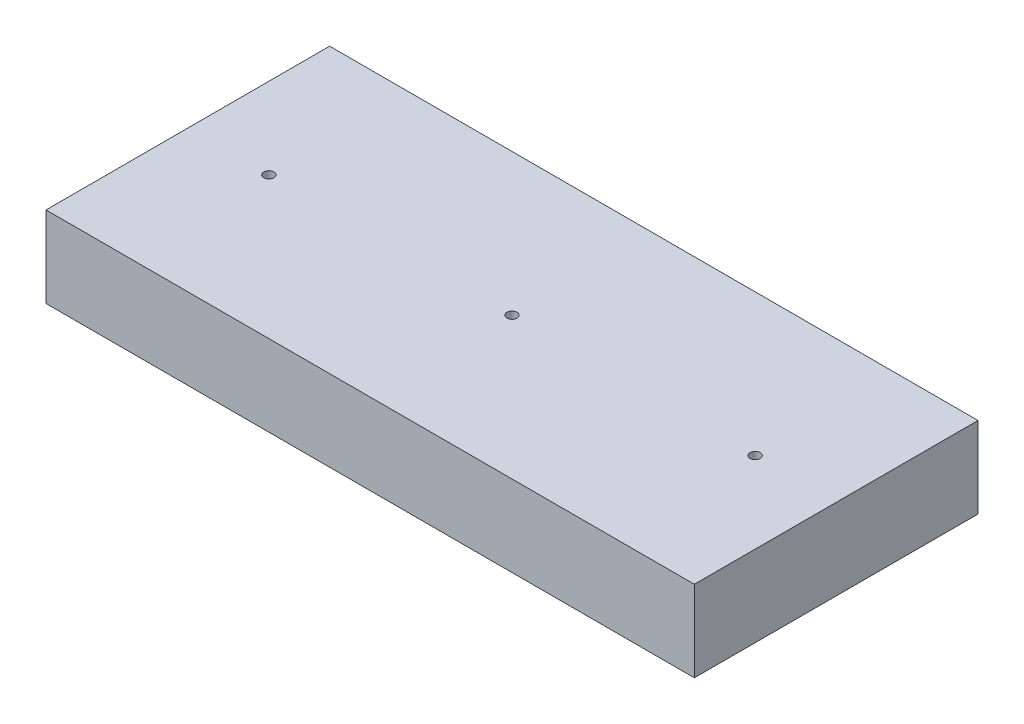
ISO-10303-21;
HEADER;
FILE_DESCRIPTION(('STEP AP214'),'2;1');
FILE_NAME('part.step','',(''),(''),'','','');
FILE_SCHEMA(('AUTOMOTIVE_DESIGN { 1 0 10303 214 1 1 1 1 }'));
ENDSEC;
DATA;
#1=APPLICATION_CONTEXT('core data for automotive mechanical design processes');
#2=APPLICATION_PROTOCOL_DEFINITION('international standard','automotive_design',2000,#1);
#3=PRODUCT_CONTEXT('',#1,'mechanical');
#4=PRODUCT('Part','Part','',(#3));
#5=PRODUCT_RELATED_PRODUCT_CATEGORY('part','',(#4));
#6=PRODUCT_DEFINITION_FORMATION('','',#4);
#7=PRODUCT_DEFINITION_CONTEXT('part definition',#1,'design');
#8=PRODUCT_DEFINITION('design','',#6,#7);
#9=PRODUCT_DEFINITION_SHAPE('','',#8);
#10=(LENGTH_UNIT() NAMED_UNIT(*) SI_UNIT(.MILLI.,.METRE.));
#11=(NAMED_UNIT(*) PLANE_ANGLE_UNIT() SI_UNIT($,.RADIAN.));
#12=(NAMED_UNIT(*) SI_UNIT($,.STERADIAN.) SOLID_ANGLE_UNIT());
#13=UNCERTAINTY_MEASURE_WITH_UNIT(LENGTH_MEASURE(1.E-05),#10,'distance_accuracy_value','');
#14=(GEOMETRIC_REPRESENTATION_CONTEXT(3) GLOBAL_UNCERTAINTY_ASSIGNED_CONTEXT((#13)) GLOBAL_UNIT_ASSIGNED_CONTEXT((#10,
#11,#12)) REPRESENTATION_CONTEXT('',''));
#15=CARTESIAN_POINT('',(0.,0.,0.));
#16=DIRECTION('',(0.,0.,1.));
#17=DIRECTION('',(1.,0.,0.));
#18=AXIS2_PLACEMENT_3D('',#15,#16,#17);
#19=CARTESIAN_POINT('',(-101.6,25.4000000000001,-44.4499999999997));
#20=DIRECTION('',(1.,0.,0.));
#21=DIRECTION('',(0.,0.,-0.999999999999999));
#22=AXIS2_PLACEMENT_3D('',#19,#20,#21);
#23=PLANE('',#22);
#24=DIRECTION('',(0.,0.,0.999999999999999));
#25=VECTOR('',#24,1.);
#26=CARTESIAN_POINT('',(-101.6,0.,-44.45));
#27=LINE('',#26,#25);
#28=CARTESIAN_POINT('',(-101.6,0.,-44.45));
#29=VERTEX_POINT('',#28);
#30=CARTESIAN_POINT('',(-101.6,0.,44.4500000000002));
#31=VERTEX_POINT('',#30);
#32=EDGE_CURVE('E98',#29,#31,#27,.T.);
#33=ORIENTED_EDGE('',*,*,#32,.T.);
#34=DIRECTION('',(0.,-1.,0.));
#35=VECTOR('',#34,1.);
#36=CARTESIAN_POINT('',(-101.6,25.3999999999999,44.45));
#37=LINE('',#36,#35);
#38=CARTESIAN_POINT('',(-101.6,25.3999999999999,44.45));
#39=VERTEX_POINT('',#38);
#40=EDGE_CURVE('E11',#39,#31,#37,.T.);
#41=ORIENTED_EDGE('',*,*,#40,.F.);
#42=DIRECTION('',(0.,0.,0.999999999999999));
#43=VECTOR('',#42,1.);
#44=CARTESIAN_POINT('',(-101.6,25.4000000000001,-44.4499999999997));
#45=LINE('',#44,#43);
#46=CARTESIAN_POINT('',(-101.6,25.4000000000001,-44.4499999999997));
#47=VERTEX_POINT('',#46);
#48=EDGE_CURVE('E86',#47,#39,#45,.T.);
#49=ORIENTED_EDGE('',*,*,#48,.F.);
#50=DIRECTION('',(0.,-1.,0.));
#51=VECTOR('',#50,1.);
#52=CARTESIAN_POINT('',(-101.6,25.4000000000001,-44.4499999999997));
#53=LINE('',#52,#51);
#54=EDGE_CURVE('E94',#47,#29,#53,.T.);
#55=ORIENTED_EDGE('',*,*,#54,.T.);
#56=EDGE_LOOP('',(#33,#41,#49,#55));
#57=FACE_BOUND('',#56,.T.);
#58=ADVANCED_FACE('F35',(#57),#23,.F.);
#59=CARTESIAN_POINT('',(-101.6,25.3999999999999,44.45));
#60=DIRECTION('',(0.,0.,-0.999999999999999));
#61=DIRECTION('',(-1.,0.,0.));
#62=AXIS2_PLACEMENT_3D('',#59,#60,#61);
#63=PLANE('',#62);
#64=DIRECTION('',(1.,0.,0.));
#65=VECTOR('',#64,1.);
#66=CARTESIAN_POINT('',(-101.6,0.,44.4500000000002));
#67=LINE('',#66,#65);
#68=CARTESIAN_POINT('',(101.6,0.,44.45));
#69=VERTEX_POINT('',#68);
#70=EDGE_CURVE('E90',#31,#69,#67,.T.);
#71=ORIENTED_EDGE('',*,*,#70,.T.);
#72=DIRECTION('',(0.,-1.,0.));
#73=VECTOR('',#72,1.);
#74=CARTESIAN_POINT('',(101.6,25.3999999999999,44.4500000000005));
#75=LINE('',#74,#73);
#76=CARTESIAN_POINT('',(101.6,25.3999999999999,44.4500000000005));
#77=VERTEX_POINT('',#76);
#78=EDGE_CURVE('E43',#77,#69,#75,.T.);
#79=ORIENTED_EDGE('',*,*,#78,.F.);
#80=DIRECTION('',(1.,0.,0.));
#81=VECTOR('',#80,1.);
#82=CARTESIAN_POINT('',(-101.6,25.3999999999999,44.45));
#83=LINE('',#82,#81);
#84=EDGE_CURVE('E81',#39,#77,#83,.T.);
#85=ORIENTED_EDGE('',*,*,#84,.F.);
#86=ORIENTED_EDGE('',*,*,#40,.T.);
#87=EDGE_LOOP('',(#71,#79,#85,#86));
#88=FACE_BOUND('',#87,.T.);
#89=ADVANCED_FACE('F89',(#88),#63,.F.);
#90=CARTESIAN_POINT('',(101.6,25.4000000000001,-44.45));
#91=DIRECTION('',(-1.,0.,0.));
#92=DIRECTION('',(0.,0.,0.999999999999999));
#93=AXIS2_PLACEMENT_3D('',#90,#91,#92);
#94=PLANE('',#93);
#95=DIRECTION('',(0.,0.,-0.999999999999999));
#96=VECTOR('',#95,1.);
#97=CARTESIAN_POINT('',(101.6,0.,-44.45));
#98=LINE('',#97,#96);
#99=CARTESIAN_POINT('',(101.6,0.,-44.45));
#100=VERTEX_POINT('',#99);
#101=EDGE_CURVE('E68',#69,#100,#98,.T.);
#102=ORIENTED_EDGE('',*,*,#101,.T.);
#103=DIRECTION('',(0.,-1.,0.));
#104=VECTOR('',#103,1.);
#105=CARTESIAN_POINT('',(101.6,25.4000000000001,-44.45));
#106=LINE('',#105,#104);
#107=CARTESIAN_POINT('',(101.6,25.4000000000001,-44.45));
#108=VERTEX_POINT('',#107);
#109=EDGE_CURVE('E91',#108,#100,#106,.T.);
#110=ORIENTED_EDGE('',*,*,#109,.F.);
#111=DIRECTION('',(0.,0.,-0.999999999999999));
#112=VECTOR('',#111,1.);
#113=CARTESIAN_POINT('',(101.6,25.4000000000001,-44.45));
#114=LINE('',#113,#112);
#115=EDGE_CURVE('E84',#77,#108,#114,.T.);
#116=ORIENTED_EDGE('',*,*,#115,.F.);
#117=ORIENTED_EDGE('',*,*,#78,.T.);
#118=EDGE_LOOP('',(#102,#110,#116,#117));
#119=FACE_BOUND('',#118,.T.);
#120=ADVANCED_FACE('F92',(#119),#94,.F.);
#121=CARTESIAN_POINT('',(-101.6,25.4000000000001,-44.4499999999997));
#122=DIRECTION('',(0.,0.,0.999999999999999));
#123=DIRECTION('',(1.,0.,0.));
#124=AXIS2_PLACEMENT_3D('',#121,#122,#123);
#125=PLANE('',#124);
#126=DIRECTION('',(-1.,0.,0.));
#127=VECTOR('',#126,1.);
#128=CARTESIAN_POINT('',(-101.6,0.,-44.45));
#129=LINE('',#128,#127);
#130=EDGE_CURVE('E74',#100,#29,#129,.T.);
#131=ORIENTED_EDGE('',*,*,#130,.T.);
#132=ORIENTED_EDGE('',*,*,#54,.F.);
#133=DIRECTION('',(-1.,0.,0.));
#134=VECTOR('',#133,1.);
#135=CARTESIAN_POINT('',(-101.6,25.4000000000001,-44.4499999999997));
#136=LINE('',#135,#134);
#137=EDGE_CURVE('E51',#108,#47,#136,.T.);
#138=ORIENTED_EDGE('',*,*,#137,.F.);
#139=ORIENTED_EDGE('',*,*,#109,.T.);
#140=EDGE_LOOP('',(#131,#132,#138,#139));
#141=FACE_BOUND('',#140,.T.);
#142=ADVANCED_FACE('F106',(#141),#125,.F.);
#143=CARTESIAN_POINT('',(0.,25.4000000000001,0.));
#144=DIRECTION('',(0.,1.,0.));
#145=DIRECTION('',(0.,0.,0.999999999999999));
#146=AXIS2_PLACEMENT_3D('',#143,#144,#145);
#147=PLANE('',#146);
#148=CARTESIAN_POINT('',(0.,25.4000000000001,0.));
#149=DIRECTION('',(0.,-1.,0.));
#150=DIRECTION('',(0.,0.,-0.999999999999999));
#151=AXIS2_PLACEMENT_3D('',#148,#149,#150);
#152=CIRCLE('',#151,1.5875);
#153=CARTESIAN_POINT('',(0.,25.4000000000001,-1.5875));
#154=VERTEX_POINT('',#153);
#155=EDGE_CURVE('E121',#154,#154,#152,.T.);
#156=ORIENTED_EDGE('',*,*,#155,.T.);
#157=EDGE_LOOP('',(#156));
#158=FACE_BOUND('',#157,.T.);
#159=CARTESIAN_POINT('',(-76.1999999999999,25.4000000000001,2.22044604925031E-13));
#160=DIRECTION('',(0.,-1.,0.));
#161=DIRECTION('',(0.,0.,-0.999999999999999));
#162=AXIS2_PLACEMENT_3D('',#159,#160,#161);
#163=CIRCLE('',#162,1.58749999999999);
#164=CARTESIAN_POINT('',(-76.1999999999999,25.4000000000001,-1.58749999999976));
#165=VERTEX_POINT('',#164);
#166=EDGE_CURVE('E115',#165,#165,#163,.T.);
#167=ORIENTED_EDGE('',*,*,#166,.T.);
#168=EDGE_LOOP('',(#167));
#169=FACE_BOUND('',#168,.T.);
#170=CARTESIAN_POINT('',(76.2,25.4000000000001,2.22044604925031E-13));
#171=DIRECTION('',(0.,-1.,0.));
#172=DIRECTION('',(0.,0.,-0.999999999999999));
#173=AXIS2_PLACEMENT_3D('',#170,#171,#172);
#174=CIRCLE('',#173,1.58749999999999);
#175=CARTESIAN_POINT('',(76.2,25.4000000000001,-1.58749999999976));
#176=VERTEX_POINT('',#175);
#177=EDGE_CURVE('E101',#176,#176,#174,.T.);
#178=ORIENTED_EDGE('',*,*,#177,.T.);
#179=EDGE_LOOP('',(#178));
#180=FACE_BOUND('',#179,.T.);
#181=ORIENTED_EDGE('',*,*,#48,.T.);
#182=ORIENTED_EDGE('',*,*,#84,.T.);
#183=ORIENTED_EDGE('',*,*,#115,.T.);
#184=ORIENTED_EDGE('',*,*,#137,.T.);
#185=EDGE_LOOP('',(#181,#182,#183,#184));
#186=FACE_BOUND('',#185,.T.);
#187=ADVANCED_FACE('F82',(#158,#169,#180,#186),#147,.T.);
#188=CARTESIAN_POINT('',(0.,0.,0.));
#189=DIRECTION('',(0.,1.,0.));
#190=DIRECTION('',(0.,0.,0.999999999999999));
#191=AXIS2_PLACEMENT_3D('',#188,#189,#190);
#192=PLANE('',#191);
#193=CARTESIAN_POINT('',(0.,0.,0.));
#194=DIRECTION('',(0.,-1.,0.));
#195=DIRECTION('',(0.,0.,-0.999999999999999));
#196=AXIS2_PLACEMENT_3D('',#193,#194,#195);
#197=CIRCLE('',#196,1.5875);
#198=CARTESIAN_POINT('',(0.,0.,-1.5875));
#199=VERTEX_POINT('',#198);
#200=EDGE_CURVE('E124',#199,#199,#197,.T.);
#201=ORIENTED_EDGE('',*,*,#200,.F.);
#202=EDGE_LOOP('',(#201));
#203=FACE_BOUND('',#202,.T.);
#204=CARTESIAN_POINT('',(-76.1999999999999,-2.22044604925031E-13,3.33066907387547E-13));
#205=DIRECTION('',(0.,-1.,0.));
#206=DIRECTION('',(0.,0.,-0.999999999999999));
#207=AXIS2_PLACEMENT_3D('',#204,#205,#206);
#208=CIRCLE('',#207,1.58749999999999);
#209=CARTESIAN_POINT('',(-76.1999999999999,-2.23322402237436E-13,-1.58749999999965));
#210=VERTEX_POINT('',#209);
#211=EDGE_CURVE('E118',#210,#210,#208,.T.);
#212=ORIENTED_EDGE('',*,*,#211,.F.);
#213=EDGE_LOOP('',(#212));
#214=FACE_BOUND('',#213,.T.);
#215=CARTESIAN_POINT('',(76.2000000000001,0.,1.11022302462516E-13));
#216=DIRECTION('',(0.,-1.,0.));
#217=DIRECTION('',(0.,0.,-0.999999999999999));
#218=AXIS2_PLACEMENT_3D('',#215,#216,#217);
#219=CIRCLE('',#218,1.58749999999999);
#220=CARTESIAN_POINT('',(76.2000000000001,0.,-1.58749999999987));
#221=VERTEX_POINT('',#220);
#222=EDGE_CURVE('E112',#221,#221,#219,.T.);
#223=ORIENTED_EDGE('',*,*,#222,.F.);
#224=EDGE_LOOP('',(#223));
#225=FACE_BOUND('',#224,.T.);
#226=ORIENTED_EDGE('',*,*,#32,.F.);
#227=ORIENTED_EDGE('',*,*,#130,.F.);
#228=ORIENTED_EDGE('',*,*,#101,.F.);
#229=ORIENTED_EDGE('',*,*,#70,.F.);
#230=EDGE_LOOP('',(#226,#227,#228,#229));
#231=FACE_BOUND('',#230,.T.);
#232=ADVANCED_FACE('F109',(#203,#214,#225,#231),#192,.F.);
#233=CARTESIAN_POINT('',(76.2,25.4000000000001,2.22044604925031E-13));
#234=DIRECTION('',(0.,-1.,0.));
#235=DIRECTION('',(0.,0.,-0.999999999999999));
#236=AXIS2_PLACEMENT_3D('',#233,#234,#235);
#237=CYLINDRICAL_SURFACE('',#236,1.58749999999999);
#238=ORIENTED_EDGE('',*,*,#177,.F.);
#239=EDGE_LOOP('',(#238));
#240=FACE_BOUND('',#239,.T.);
#241=ORIENTED_EDGE('',*,*,#222,.T.);
#242=EDGE_LOOP('',(#241));
#243=FACE_BOUND('',#242,.T.);
#244=ADVANCED_FACE('F141',(#240,#243),#237,.F.);
#245=CARTESIAN_POINT('',(-76.1999999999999,25.4000000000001,2.22044604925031E-13));
#246=DIRECTION('',(0.,-1.,0.));
#247=DIRECTION('',(0.,0.,-0.999999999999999));
#248=AXIS2_PLACEMENT_3D('',#245,#246,#247);
#249=CYLINDRICAL_SURFACE('',#248,1.58749999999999);
#250=ORIENTED_EDGE('',*,*,#166,.F.);
#251=EDGE_LOOP('',(#250));
#252=FACE_BOUND('',#251,.T.);
#253=ORIENTED_EDGE('',*,*,#211,.T.);
#254=EDGE_LOOP('',(#253));
#255=FACE_BOUND('',#254,.T.);
#256=ADVANCED_FACE('F135',(#252,#255),#249,.F.);
#257=CARTESIAN_POINT('',(0.,25.4000000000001,0.));
#258=DIRECTION('',(0.,-1.,0.));
#259=DIRECTION('',(0.,0.,-0.999999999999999));
#260=AXIS2_PLACEMENT_3D('',#257,#258,#259);
#261=CYLINDRICAL_SURFACE('',#260,1.5875);
#262=ORIENTED_EDGE('',*,*,#155,.F.);
#263=EDGE_LOOP('',(#262));
#264=FACE_BOUND('',#263,.T.);
#265=ORIENTED_EDGE('',*,*,#200,.T.);
#266=EDGE_LOOP('',(#265));
#267=FACE_BOUND('',#266,.T.);
#268=ADVANCED_FACE('F132',(#264,#267),#261,.F.);
#269=CLOSED_SHELL('',(#58,#89,#120,#142,#187,#232,#244,#256,#268));
#270=MANIFOLD_SOLID_BREP('B2',#269);
#271=ADVANCED_BREP_SHAPE_REPRESENTATION('',(#18,#270),#14);
#272=SHAPE_DEFINITION_REPRESENTATION(#9,#271);
ENDSEC;
END-ISO-10303-21;
